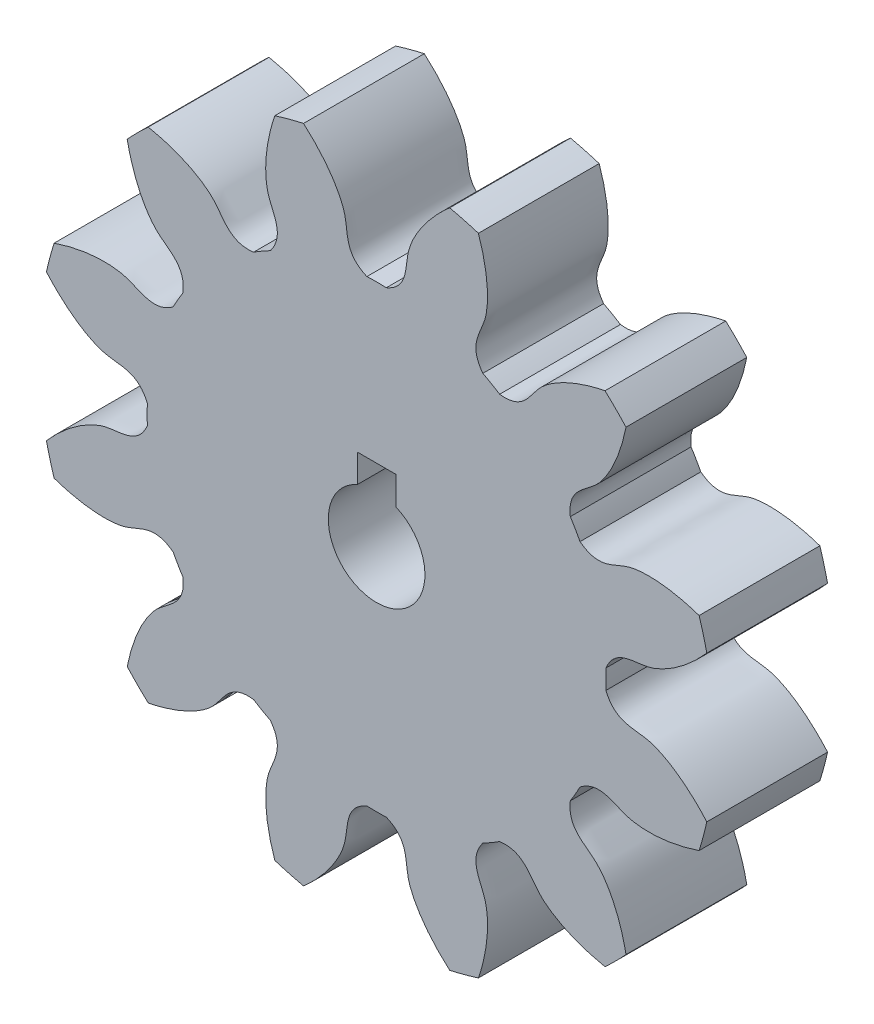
from build123d import *

# Parameters (mm, degrees)
SKETCH_1_R               = 14
EXTRUDE_1_DEPTH          = 5
CUT_EXTRUDE_1_DEPTH      = 21.420577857
PATTERN_CIRCULAR_1_COUNT = 12
CUT_EXTRUDE_2_DEPTH      = 10


with BuildPart() as part:
    # Sketch 1 → Extrude 1 (new body)
    with BuildSketch(Plane.XY):
        Circle(SKETCH_1_R)
    extrude(amount=EXTRUDE_1_DEPTH)

    # Sketch 2 → Cut-Extrude 1 (cut, through all)
    with BuildSketch(Plane.XY):
        with BuildLine():
            ThreePointArc((0.401680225, 9.491504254), (0, 9.5), (-0.401680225, 9.491504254))
            add(Edge.make_bspline(
                [(-0.401680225, 9.491504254), (-1.361577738, 9.898614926), (-1.148746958, 10.689637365), (-1.352304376, 11.378961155), (-1.365247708, 11.419811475), (-1.380454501, 11.46466685), (-1.398085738, 11.513452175), (-1.41830525, 11.566086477), (-1.441273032, 11.622484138), (-1.467147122, 11.682554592), (-1.496082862, 11.746202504), (-1.528232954, 11.813327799), (-1.563747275, 11.883825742), (-1.602772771, 11.957587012), (-1.645453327, 12.034497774), (-1.691929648, 12.114439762), (-1.742339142, 12.197290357), (-1.796815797, 12.282922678), (-1.855490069, 12.371205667), (-1.918488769, 12.462004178), (-1.985934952, 12.555179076), (-2.057947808, 12.650587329), (-2.134642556, 12.748082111), (-2.216130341, 12.847512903), (-2.302518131, 12.948725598), (-2.39390862, 13.051562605), (-2.490400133, 13.155862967), (-2.59208653, 13.261462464), (-2.699057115, 13.368193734), (-2.811396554, 13.475886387), (-2.929184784, 13.584367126), (-3.052496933, 13.693459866), (-3.181403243, 13.802985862), (-3.31596899, 13.912763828), (-3.456254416, 14.02261007), (-3.602314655, 14.132338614), (-3.754199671, 14.241761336), (-3.911954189, 14.350688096), (-4.07561764, 14.458926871), (-4.2452241, 14.566283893), (-4.420802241, 14.672563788), (-4.602375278, 14.77756971), (-4.789960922, 14.881103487), (-4.983571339, 14.98296576), (-5.183213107, 15.082956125), (-5.388887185, 15.18087328), (-5.600588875, 15.276515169), (-5.818307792, 15.369679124), (-6.042027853, 15.460162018), (-6.27172721, 15.547760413), (-6.588759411, 15.661455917), (-6.8311872, 15.740202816), (-6.995210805, 15.78994182)],
                knots=[0, 0, 0, 0, 0.218015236, 0.222043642, 0.226545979, 0.231522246, 0.236972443, 0.24289657, 0.249294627, 0.256166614, 0.263512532, 0.271332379, 0.279626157, 0.288393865, 0.297635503, 0.307351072, 0.31754057, 0.328203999, 0.339341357, 0.350952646, 0.363037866, 0.375597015, 0.388630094, 0.402137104, 0.416118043, 0.430572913, 0.445501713, 0.460904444, 0.476781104, 0.493131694, 0.509956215, 0.527254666, 0.545027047, 0.563273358, 0.581993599, 0.601187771, 0.620855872, 0.640997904, 0.661613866, 0.682703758, 0.704267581, 0.726305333, 0.748817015, 0.771802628, 0.795262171, 0.819195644, 0.843603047, 0.868484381, 0.893839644, 0.919668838, 0.945971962, 1, 1, 1, 1], degree=3))
            ThreePointArc((-6.995210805, 15.78994182), (0, 17.270067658), (6.995210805, 15.78994182))
            add(Edge.make_bspline(
                [(0.401680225, 9.491504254), (1.361577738, 9.898614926), (1.148746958, 10.689637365), (1.352304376, 11.378961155), (1.365247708, 11.419811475), (1.380454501, 11.46466685), (1.398085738, 11.513452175), (1.41830525, 11.566086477), (1.441273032, 11.622484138), (1.467147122, 11.682554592), (1.496082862, 11.746202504), (1.528232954, 11.813327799), (1.563747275, 11.883825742), (1.602772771, 11.957587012), (1.645453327, 12.034497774), (1.691929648, 12.114439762), (1.742339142, 12.197290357), (1.796815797, 12.282922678), (1.855490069, 12.371205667), (1.918488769, 12.462004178), (1.985934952, 12.555179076), (2.057947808, 12.650587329), (2.134642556, 12.748082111), (2.216130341, 12.847512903), (2.302518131, 12.948725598), (2.39390862, 13.051562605), (2.490400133, 13.155862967), (2.59208653, 13.261462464), (2.699057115, 13.368193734), (2.811396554, 13.475886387), (2.929184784, 13.584367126), (3.052496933, 13.693459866), (3.181403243, 13.802985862), (3.31596899, 13.912763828), (3.456254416, 14.02261007), (3.602314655, 14.132338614), (3.754199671, 14.241761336), (3.911954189, 14.350688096), (4.07561764, 14.458926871), (4.2452241, 14.566283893), (4.420802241, 14.672563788), (4.602375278, 14.77756971), (4.789960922, 14.881103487), (4.983571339, 14.98296576), (5.183213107, 15.082956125), (5.388887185, 15.18087328), (5.600588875, 15.276515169), (5.818307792, 15.369679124), (6.042027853, 15.460162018), (6.27172721, 15.547760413), (6.588759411, 15.661455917), (6.8311872, 15.740202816), (6.995210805, 15.78994182)],
                knots=[0, 0, 0, 0, 0.218015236, 0.222043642, 0.226545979, 0.231522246, 0.236972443, 0.24289657, 0.249294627, 0.256166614, 0.263512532, 0.271332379, 0.279626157, 0.288393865, 0.297635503, 0.307351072, 0.31754057, 0.328203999, 0.339341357, 0.350952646, 0.363037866, 0.375597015, 0.388630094, 0.402137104, 0.416118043, 0.430572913, 0.445501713, 0.460904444, 0.476781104, 0.493131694, 0.509956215, 0.527254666, 0.545027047, 0.563273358, 0.581993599, 0.601187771, 0.620855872, 0.640997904, 0.661613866, 0.682703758, 0.704267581, 0.726305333, 0.748817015, 0.771802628, 0.795262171, 0.819195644, 0.843603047, 0.868484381, 0.893839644, 0.919668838, 0.945971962, 1, 1, 1, 1], degree=3))
        make_face()
    cut_extrude_1 = extrude(amount=CUT_EXTRUDE_1_DEPTH, mode=Mode.SUBTRACT)

    # Pattern Circular 1: Cut-Extrude 1 ×12 about axis
    pattern_circular_1_axis = Axis((0, 0, 5), (0, 0, -1))
    for i in range(1, PATTERN_CIRCULAR_1_COUNT):
        add(cut_extrude_1.rotate(pattern_circular_1_axis, i * 360 / PATTERN_CIRCULAR_1_COUNT), mode=Mode.SUBTRACT)

    # Sketch 4 → Cut-Extrude 2 (cut)
    with BuildSketch(Plane.XY.offset(5)):
        with BuildLine():
            ThreePointArc((2, 0), (1.673320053, 1.095445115), (0.8, 1.833030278))
            Line((0.8, 1.833030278), (0.8, 1))
            Line((0.8, 1), (-0.8, 1))
            Line((-0.8, 1), (-0.8, 1.833030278))
            ThreePointArc((-0.8, 1.833030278), (-1.095445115, -1.673320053), (2, 0))
        make_face()
        with BuildLine():
            Line((0.8, 1), (0.8, 1.833030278))
            ThreePointArc((0.8, 1.833030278), (0, 2), (-0.8, 1.833030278))
            Line((-0.8, 1.833030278), (-0.8, 1))
            Line((-0.8, 1), (0.8, 1))
        make_face()
        with BuildLine():
            ThreePointArc((2, 0), (1.673320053, 1.095445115), (0.8, 1.833030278))
            Line((0.8, 1.833030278), (0.8, 1))
            Line((0.8, 1), (-0.8, 1))
            Line((-0.8, 1), (-0.8, 1.833030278))
            ThreePointArc((-0.8, 1.833030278), (-1.095445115, -1.673320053), (2, 0))
        make_face()
        with BuildLine():
            Line((0.8, 1), (0.8, 1.833030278))
            ThreePointArc((0.8, 1.833030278), (0, 2), (-0.8, 1.833030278))
            Line((-0.8, 1.833030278), (-0.8, 1))
            Line((-0.8, 1), (0.8, 1))
        make_face()
        with BuildLine():
            Line((0.8, 1.833030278), (0.8, 3))
            Line((0.8, 3), (-0.8, 3))
            Line((-0.8, 3), (-0.8, 1.833030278))
            ThreePointArc((-0.8, 1.833030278), (0, 2), (0.8, 1.833030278))
        make_face()
    extrude(amount=-CUT_EXTRUDE_2_DEPTH, mode=Mode.SUBTRACT)


solid = part.part
